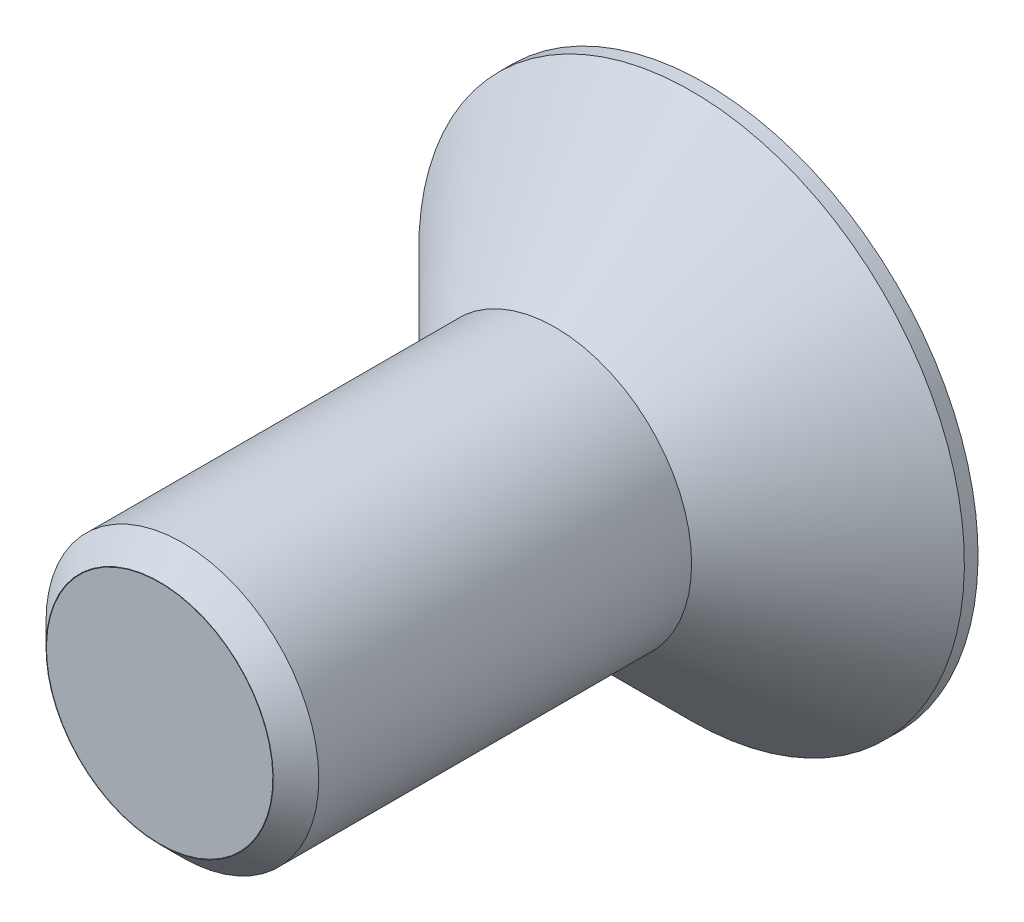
from build123d import *

# Parameters (mm, degrees)
CUT_EXTRUDE1_DEPTH = 2.5


with BuildPart() as part:
    # Sketch1 → Revolve1 (revolve)
    with BuildSketch(Plane(origin=(0, 0, -16), x_dir=(0, 0, 1), z_dir=(-1, 0, 0)), mode=Mode.PRIVATE) as revolve1_sk:
        Polygon((16, 0), (16, 6), (16.3, 6), (19.3, 3), (27.5, 3), (28, 2.5), (22.49, 2.5), (22, 2.99), (21.99, 2.99), (22.49, 2.49), (28, 2.49), (28, 0), align=None)
    revolve(revolve1_sk.sketch.rotate(Axis((0, 0, 0), (0, 0, -1)), 180), axis=Axis((0, 0, 0), (0, 0, -1)))

    # Sketch2 → Cut-Extrude1 (cut)
    with BuildSketch(Plane(origin=(0, 0, 0), x_dir=(-1, 0, 0), z_dir=(0, 0, -1))):
        Polygon((1.154700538, -2), (2.309401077, 0), (1.154700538, 2), (-1.154700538, 2), (-2.309401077, 0), (-1.154700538, -2), align=None)
    extrude(amount=-CUT_EXTRUDE1_DEPTH, mode=Mode.SUBTRACT)


solid = part.part
